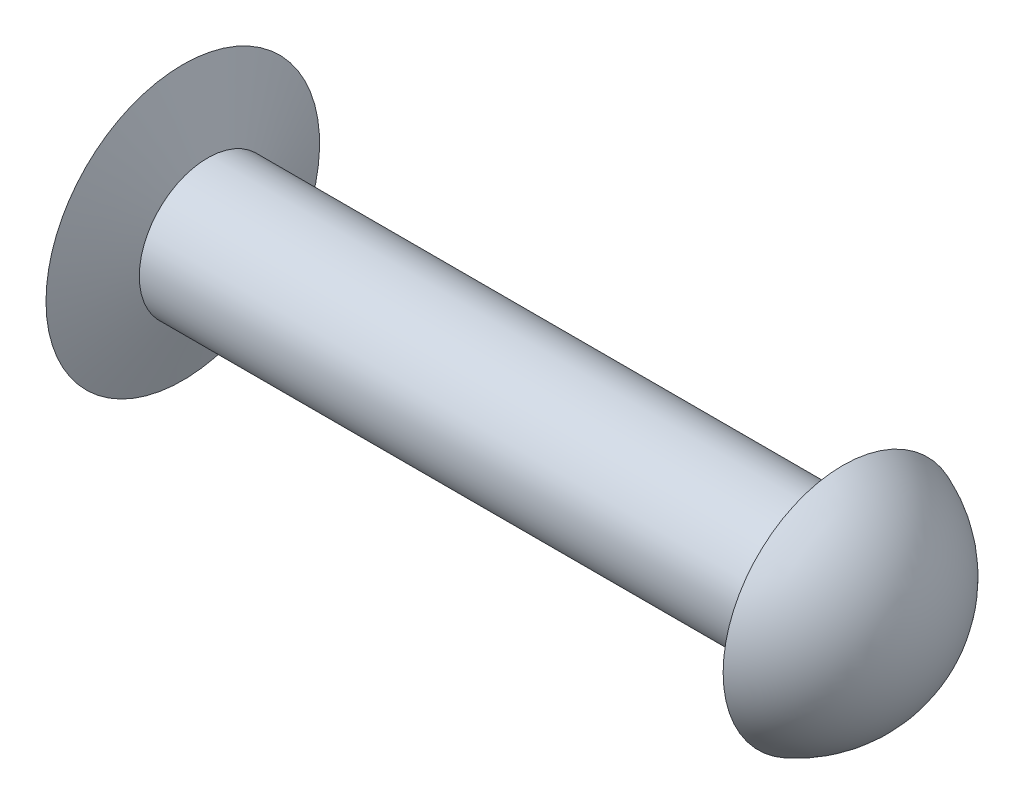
ISO-10303-21;
HEADER;
FILE_DESCRIPTION(('STEP AP214'),'2;1');
FILE_NAME('part.step','',(''),(''),'','','');
FILE_SCHEMA(('AUTOMOTIVE_DESIGN { 1 0 10303 214 1 1 1 1 }'));
ENDSEC;
DATA;
#1=APPLICATION_CONTEXT('core data for automotive mechanical design processes');
#2=APPLICATION_PROTOCOL_DEFINITION('international standard','automotive_design',2000,#1);
#3=PRODUCT_CONTEXT('',#1,'mechanical');
#4=PRODUCT('Part','Part','',(#3));
#5=PRODUCT_RELATED_PRODUCT_CATEGORY('part','',(#4));
#6=PRODUCT_DEFINITION_FORMATION('','',#4);
#7=PRODUCT_DEFINITION_CONTEXT('part definition',#1,'design');
#8=PRODUCT_DEFINITION('design','',#6,#7);
#9=PRODUCT_DEFINITION_SHAPE('','',#8);
#10=(LENGTH_UNIT() NAMED_UNIT(*) SI_UNIT(.MILLI.,.METRE.));
#11=(NAMED_UNIT(*) PLANE_ANGLE_UNIT() SI_UNIT($,.RADIAN.));
#12=(NAMED_UNIT(*) SI_UNIT($,.STERADIAN.) SOLID_ANGLE_UNIT());
#13=UNCERTAINTY_MEASURE_WITH_UNIT(LENGTH_MEASURE(1.E-05),#10,'distance_accuracy_value','');
#14=(GEOMETRIC_REPRESENTATION_CONTEXT(3) GLOBAL_UNCERTAINTY_ASSIGNED_CONTEXT((#13)) GLOBAL_UNIT_ASSIGNED_CONTEXT((#10,
#11,#12)) REPRESENTATION_CONTEXT('',''));
#15=CARTESIAN_POINT('',(0.,0.,0.));
#16=DIRECTION('',(0.,0.,1.));
#17=DIRECTION('',(1.,0.,0.));
#18=AXIS2_PLACEMENT_3D('',#15,#16,#17);
#19=CARTESIAN_POINT('',(-39.,0.,0.));
#20=DIRECTION('',(-1.,0.,0.));
#21=DIRECTION('',(0.,0.,1.));
#22=AXIS2_PLACEMENT_3D('',#19,#20,#21);
#23=CYLINDRICAL_SURFACE('',#22,3.);
#24=CARTESIAN_POINT('',(-27.858858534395,0.,0.));
#25=DIRECTION('',(-1.,0.,0.));
#26=DIRECTION('',(0.,0.,1.));
#27=AXIS2_PLACEMENT_3D('',#24,#25,#26);
#28=CIRCLE('',#27,3.);
#29=CARTESIAN_POINT('',(-27.858858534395,0.,3.));
#30=VERTEX_POINT('',#29);
#31=EDGE_CURVE('E10',#30,#30,#28,.T.);
#32=ORIENTED_EDGE('',*,*,#31,.F.);
#33=EDGE_LOOP('',(#32));
#34=FACE_BOUND('',#33,.T.);
#35=CARTESIAN_POINT('',(0.,0.,0.));
#36=DIRECTION('',(1.,0.,0.));
#37=DIRECTION('',(0.,0.,-1.));
#38=AXIS2_PLACEMENT_3D('',#35,#36,#37);
#39=CIRCLE('',#38,3.);
#40=CARTESIAN_POINT('',(0.,0.,-3.));
#41=VERTEX_POINT('',#40);
#42=EDGE_CURVE('E41',#41,#41,#39,.T.);
#43=ORIENTED_EDGE('',*,*,#42,.F.);
#44=EDGE_LOOP('',(#43));
#45=FACE_BOUND('',#44,.T.);
#46=ADVANCED_FACE('F31',(#34,#45),#23,.T.);
#47=CARTESIAN_POINT('',(-27.858858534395,0.,0.));
#48=DIRECTION('',(-1.,0.,0.));
#49=DIRECTION('',(0.,0.,1.));
#50=AXIS2_PLACEMENT_3D('',#47,#48,#49);
#51=CONICAL_SURFACE('',#50,3.,1.22173047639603);
#52=CARTESIAN_POINT('',(-28.9507692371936,0.,0.));
#53=DIRECTION('',(-1.,0.,0.));
#54=DIRECTION('',(0.,0.,1.));
#55=AXIS2_PLACEMENT_3D('',#52,#53,#54);
#56=CIRCLE('',#55,6.);
#57=CARTESIAN_POINT('',(-28.9507692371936,0.,6.));
#58=VERTEX_POINT('',#57);
#59=EDGE_CURVE('E37',#58,#58,#56,.T.);
#60=ORIENTED_EDGE('',*,*,#59,.F.);
#61=EDGE_LOOP('',(#60));
#62=FACE_BOUND('',#61,.T.);
#63=ORIENTED_EDGE('',*,*,#31,.T.);
#64=EDGE_LOOP('',(#63));
#65=FACE_BOUND('',#64,.T.);
#66=ADVANCED_FACE('F63',(#62,#65),#51,.T.);
#67=CARTESIAN_POINT('',(-20.9507692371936,0.,0.));
#68=DIRECTION('',(-1.,0.,0.));
#69=DIRECTION('',(0.,1.,0.));
#70=AXIS2_PLACEMENT_3D('',#67,#68,#69);
#71=SPHERICAL_SURFACE('',#70,10.);
#72=ORIENTED_EDGE('',*,*,#59,.T.);
#73=EDGE_LOOP('',(#72));
#74=FACE_BOUND('',#73,.T.);
#75=ADVANCED_FACE('F59',(#74),#71,.T.);
#76=CARTESIAN_POINT('',(0.,0.,0.));
#77=DIRECTION('',(1.,0.,0.));
#78=DIRECTION('',(0.,0.,-1.));
#79=AXIS2_PLACEMENT_3D('',#76,#77,#78);
#80=PLANE('',#79);
#81=ORIENTED_EDGE('',*,*,#42,.T.);
#82=EDGE_LOOP('',(#81));
#83=FACE_BOUND('',#82,.T.);
#84=CARTESIAN_POINT('',(0.,0.,0.));
#85=DIRECTION('',(-1.,0.,0.));
#86=DIRECTION('',(0.,0.,1.));
#87=AXIS2_PLACEMENT_3D('',#84,#85,#86);
#88=CIRCLE('',#87,5.25);
#89=CARTESIAN_POINT('',(0.,0.,5.25));
#90=VERTEX_POINT('',#89);
#91=EDGE_CURVE('E45',#90,#90,#88,.T.);
#92=ORIENTED_EDGE('',*,*,#91,.T.);
#93=EDGE_LOOP('',(#92));
#94=FACE_BOUND('',#93,.T.);
#95=ADVANCED_FACE('F51',(#83,#94),#80,.F.);
#96=CARTESIAN_POINT('',(-2.028125,0.,0.));
#97=DIRECTION('',(-1.,0.,0.));
#98=DIRECTION('',(0.,1.,0.));
#99=AXIS2_PLACEMENT_3D('',#96,#97,#98);
#100=SPHERICAL_SURFACE('',#99,5.628125);
#101=ORIENTED_EDGE('',*,*,#91,.F.);
#102=EDGE_LOOP('',(#101));
#103=FACE_BOUND('',#102,.T.);
#104=ADVANCED_FACE('F53',(#103),#100,.T.);
#105=CLOSED_SHELL('',(#46,#66,#75,#95,#104));
#106=MANIFOLD_SOLID_BREP('B2',#105);
#107=ADVANCED_BREP_SHAPE_REPRESENTATION('',(#18,#106),#14);
#108=SHAPE_DEFINITION_REPRESENTATION(#9,#107);
ENDSEC;
END-ISO-10303-21;
